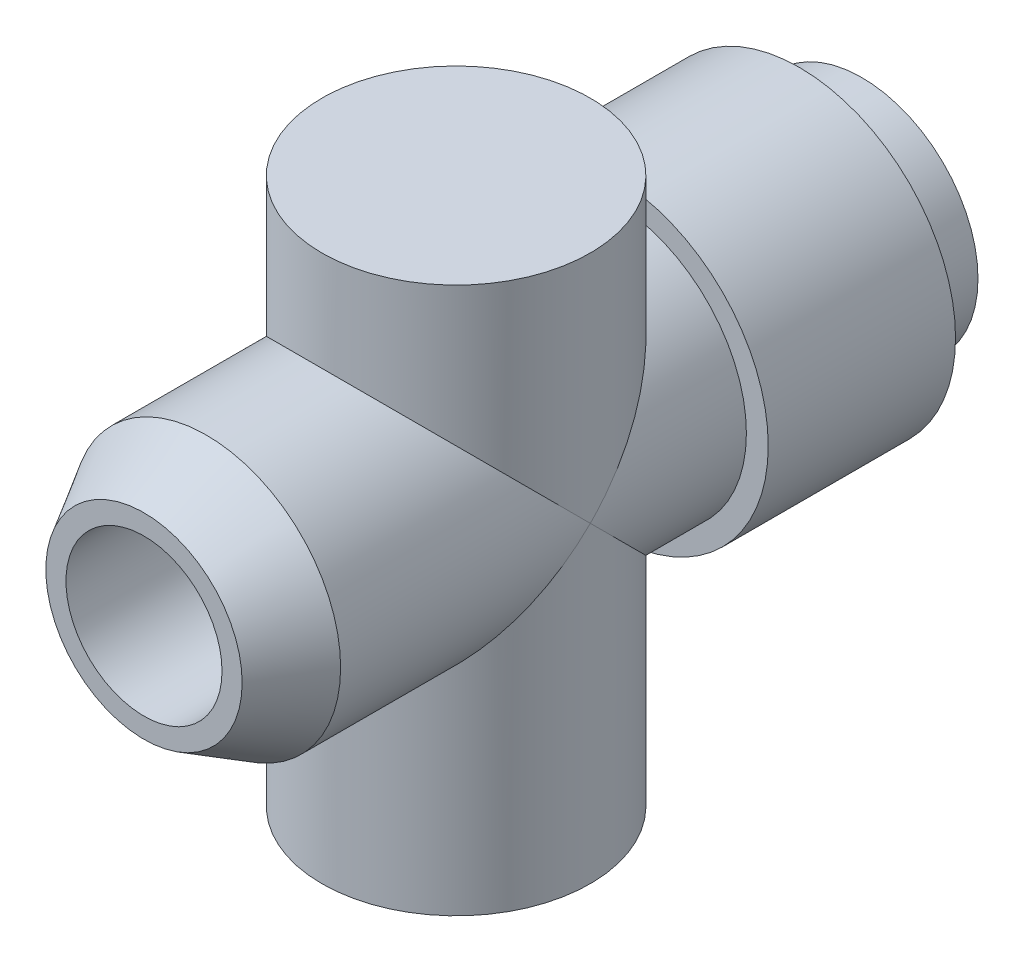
ISO-10303-21;
HEADER;
FILE_DESCRIPTION(('STEP AP214'),'2;1');
FILE_NAME('part.step','',(''),(''),'','','');
FILE_SCHEMA(('AUTOMOTIVE_DESIGN { 1 0 10303 214 1 1 1 1 }'));
ENDSEC;
DATA;
#1=APPLICATION_CONTEXT('core data for automotive mechanical design processes');
#2=APPLICATION_PROTOCOL_DEFINITION('international standard','automotive_design',2000,#1);
#3=PRODUCT_CONTEXT('',#1,'mechanical');
#4=PRODUCT('Part','Part','',(#3));
#5=PRODUCT_RELATED_PRODUCT_CATEGORY('part','',(#4));
#6=PRODUCT_DEFINITION_FORMATION('','',#4);
#7=PRODUCT_DEFINITION_CONTEXT('part definition',#1,'design');
#8=PRODUCT_DEFINITION('design','',#6,#7);
#9=PRODUCT_DEFINITION_SHAPE('','',#8);
#10=(LENGTH_UNIT() NAMED_UNIT(*) SI_UNIT(.MILLI.,.METRE.));
#11=(NAMED_UNIT(*) PLANE_ANGLE_UNIT() SI_UNIT($,.RADIAN.));
#12=(NAMED_UNIT(*) SI_UNIT($,.STERADIAN.) SOLID_ANGLE_UNIT());
#13=UNCERTAINTY_MEASURE_WITH_UNIT(LENGTH_MEASURE(1.E-05),#10,'distance_accuracy_value','');
#14=(GEOMETRIC_REPRESENTATION_CONTEXT(3) GLOBAL_UNCERTAINTY_ASSIGNED_CONTEXT((#13)) GLOBAL_UNIT_ASSIGNED_CONTEXT((#10,
#11,#12)) REPRESENTATION_CONTEXT('',''));
#15=CARTESIAN_POINT('',(0.,0.,0.));
#16=DIRECTION('',(0.,0.,1.));
#17=DIRECTION('',(1.,0.,0.));
#18=AXIS2_PLACEMENT_3D('',#15,#16,#17);
#19=CARTESIAN_POINT('',(0.,7.9375,16.51));
#20=DIRECTION('',(0.,-1.,0.));
#21=DIRECTION('',(0.,0.,-1.));
#22=AXIS2_PLACEMENT_3D('',#19,#20,#21);
#23=PLANE('',#22);
#24=CARTESIAN_POINT('',(0.,7.9375,16.51));
#25=DIRECTION('',(0.,-1.,0.));
#26=DIRECTION('',(0.,0.,-1.));
#27=AXIS2_PLACEMENT_3D('',#24,#25,#26);
#28=CIRCLE('',#27,3.175);
#29=CARTESIAN_POINT('',(0.,7.9375,13.335));
#30=VERTEX_POINT('',#29);
#31=EDGE_CURVE('E143',#30,#30,#28,.T.);
#32=ORIENTED_EDGE('',*,*,#31,.T.);
#33=EDGE_LOOP('',(#32));
#34=FACE_BOUND('',#33,.T.);
#35=CARTESIAN_POINT('',(0.,7.9375,16.51));
#36=DIRECTION('',(0.,-1.,0.));
#37=DIRECTION('',(0.,0.,-1.));
#38=AXIS2_PLACEMENT_3D('',#35,#36,#37);
#39=CIRCLE('',#38,3.048);
#40=CARTESIAN_POINT('',(0.,7.9375,13.462));
#41=VERTEX_POINT('',#40);
#42=EDGE_CURVE('E140',#41,#41,#39,.T.);
#43=ORIENTED_EDGE('',*,*,#42,.F.);
#44=EDGE_LOOP('',(#43));
#45=FACE_BOUND('',#44,.T.);
#46=ADVANCED_FACE('F31',(#34,#45),#23,.T.);
#47=CARTESIAN_POINT('',(0.,0.,0.));
#48=DIRECTION('',(0.,0.,1.));
#49=DIRECTION('',(1.,0.,0.));
#50=AXIS2_PLACEMENT_3D('',#47,#48,#49);
#51=CYLINDRICAL_SURFACE('',#50,3.175);
#52=CARTESIAN_POINT('',(3.175,0.,12.0668146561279));
#53=CARTESIAN_POINT('',(3.17500007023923,0.1609359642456,12.0668142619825));
#54=CARTESIAN_POINT('',(3.16268772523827,0.321873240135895,12.0579392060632));
#55=CARTESIAN_POINT('',(3.11428183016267,0.638414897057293,12.0239548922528));
#56=CARTESIAN_POINT('',(3.07816368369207,0.794013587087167,11.9988288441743));
#57=CARTESIAN_POINT('',(2.98445917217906,1.09466445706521,11.9363107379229));
#58=CARTESIAN_POINT('',(2.9270172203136,1.23977991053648,11.8990013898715));
#59=CARTESIAN_POINT('',(2.79275630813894,1.51824307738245,11.8164688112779));
#60=CARTESIAN_POINT('',(2.71593112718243,1.6515869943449,11.7712430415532));
#61=CARTESIAN_POINT('',(2.53485186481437,1.91941848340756,11.671728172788));
#62=CARTESIAN_POINT('',(2.42846906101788,2.05230276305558,11.6169936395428));
#63=CARTESIAN_POINT('',(2.19571018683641,2.29964695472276,11.5082072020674));
#64=CARTESIAN_POINT('',(2.06932053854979,2.41409424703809,11.4541557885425));
#65=CARTESIAN_POINT('',(1.78472313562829,2.63259925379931,11.346420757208));
#66=CARTESIAN_POINT('',(1.62460215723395,2.73449702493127,11.2933065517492));
#67=CARTESIAN_POINT('',(1.37076589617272,2.86543678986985,11.2231018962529));
#68=CARTESIAN_POINT('',(1.28384803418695,2.90544151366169,11.2012726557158));
#69=CARTESIAN_POINT('',(1.10602381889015,2.9776709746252,11.1614013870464));
#70=CARTESIAN_POINT('',(1.01512006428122,3.00990069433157,11.1433569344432));
#71=CARTESIAN_POINT('',(0.838428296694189,3.06356075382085,11.1130696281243));
#72=CARTESIAN_POINT('',(0.752920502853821,3.08570388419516,11.1004498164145));
#73=CARTESIAN_POINT('',(0.579922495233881,3.12284099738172,11.0791805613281));
#74=CARTESIAN_POINT('',(0.492433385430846,3.13783886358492,11.0705289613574));
#75=CARTESIAN_POINT('',(0.31622886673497,3.16045974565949,11.0574487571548));
#76=CARTESIAN_POINT('',(0.227514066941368,3.16808629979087,11.0530181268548));
#77=CARTESIAN_POINT('',(0.0496767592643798,3.17586083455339,11.0484998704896));
#78=CARTESIAN_POINT('',(-0.0394457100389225,3.17600950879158,11.0484118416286));
#79=CARTESIAN_POINT('',(-0.285401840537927,3.16603658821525,11.0542123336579));
#80=CARTESIAN_POINT('',(-0.4418974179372,3.14797422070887,11.0647226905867));
#81=CARTESIAN_POINT('',(-0.749075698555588,3.08933954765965,11.09840542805));
#82=CARTESIAN_POINT('',(-0.899757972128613,3.04876558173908,11.1215787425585));
#83=CARTESIAN_POINT('',(-1.19291338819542,2.94650155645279,11.1787751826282));
#84=CARTESIAN_POINT('',(-1.33531247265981,2.88464759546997,11.212882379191));
#85=CARTESIAN_POINT('',(-1.60791954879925,2.74206416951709,11.2891582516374));
#86=CARTESIAN_POINT('',(-1.73812407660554,2.66132936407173,11.3313292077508));
#87=CARTESIAN_POINT('',(-1.9987432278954,2.47273639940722,11.4258187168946));
#88=CARTESIAN_POINT('',(-2.1274494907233,2.3628237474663,11.4787466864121));
#89=CARTESIAN_POINT('',(-2.3656610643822,2.1243198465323,11.5862524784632));
#90=CARTESIAN_POINT('',(-2.4751417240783,1.99570499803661,11.6408323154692));
#91=CARTESIAN_POINT('',(-2.68338007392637,1.70733032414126,11.7521291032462));
#92=CARTESIAN_POINT('',(-2.77979750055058,1.54571736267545,11.8084666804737));
#93=CARTESIAN_POINT('',(-2.94349053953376,1.20500518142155,11.9091649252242));
#94=CARTESIAN_POINT('',(-3.01081871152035,1.02593822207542,11.9535471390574));
#95=CARTESIAN_POINT('',(-3.10063899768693,0.698772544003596,12.0143605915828));
#96=CARTESIAN_POINT('',(-3.12995612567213,0.553312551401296,12.0349129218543));
#97=CARTESIAN_POINT('',(-3.16793990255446,0.258479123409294,12.061713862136));
#98=CARTESIAN_POINT('',(-3.17662774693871,0.109109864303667,12.0679771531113));
#99=CARTESIAN_POINT('',(-3.17286544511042,-0.189336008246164,12.0652900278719));
#100=CARTESIAN_POINT('',(-3.16039749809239,-0.338412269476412,12.0563267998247));
#101=CARTESIAN_POINT('',(-3.11502731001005,-0.631919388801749,12.0244826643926));
#102=CARTESIAN_POINT('',(-3.08210971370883,-0.776346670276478,12.0015912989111));
#103=CARTESIAN_POINT('',(-2.99707204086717,-1.05833340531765,11.9446204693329));
#104=CARTESIAN_POINT('',(-2.94479778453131,-1.19582735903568,11.9104514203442));
#105=CARTESIAN_POINT('',(-2.82285849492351,-1.46060654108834,11.8346240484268));
#106=CARTESIAN_POINT('',(-2.75318655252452,-1.587887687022,11.7929627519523));
#107=CARTESIAN_POINT('',(-2.58462207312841,-1.85172082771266,11.6982331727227));
#108=CARTESIAN_POINT('',(-2.48276810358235,-1.98612360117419,11.6444335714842));
#109=CARTESIAN_POINT('',(-2.25915298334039,-2.23722631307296,11.5366504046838));
#110=CARTESIAN_POINT('',(-2.13737439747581,-2.35391057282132,11.482666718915));
#111=CARTESIAN_POINT('',(-1.8610893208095,-2.57915253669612,11.3735452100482));
#112=CARTESIAN_POINT('',(-1.70445717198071,-2.68540949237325,11.3189320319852));
#113=CARTESIAN_POINT('',(-1.45534676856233,-2.82340882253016,11.2457777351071));
#114=CARTESIAN_POINT('',(-1.36991710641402,-2.86585539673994,11.2228473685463));
#115=CARTESIAN_POINT('',(-1.19485625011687,-2.94314087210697,11.1805608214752));
#116=CARTESIAN_POINT('',(-1.10522772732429,-2.97798453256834,11.1612024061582));
#117=CARTESIAN_POINT('',(-0.929633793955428,-3.03715430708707,11.1280252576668));
#118=CARTESIAN_POINT('',(-0.843933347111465,-3.0620914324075,11.113890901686));
#119=CARTESIAN_POINT('',(-0.670244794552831,-3.10473632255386,11.0895778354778));
#120=CARTESIAN_POINT('',(-0.582257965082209,-3.12244803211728,11.0793969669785));
#121=CARTESIAN_POINT('',(-0.404758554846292,-3.15037417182,11.063292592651));
#122=CARTESIAN_POINT('',(-0.315246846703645,-3.16059275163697,11.0573667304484));
#123=CARTESIAN_POINT('',(-0.135527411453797,-3.17338724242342,11.0499394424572));
#124=CARTESIAN_POINT('',(-0.045319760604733,-3.17596397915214,11.0484375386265));
#125=CARTESIAN_POINT('',(0.202978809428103,-3.17243715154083,11.0504935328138));
#126=CARTESIAN_POINT('',(0.361013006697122,-3.15833180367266,11.0587156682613));
#127=CARTESIAN_POINT('',(0.671918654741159,-3.10709333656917,11.0882380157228));
#128=CARTESIAN_POINT('',(0.824789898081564,-3.06995929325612,11.1095387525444));
#129=CARTESIAN_POINT('',(1.12098184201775,-2.97458144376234,11.1631798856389));
#130=CARTESIAN_POINT('',(1.26433889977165,-2.91642421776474,11.1954749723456));
#131=CARTESIAN_POINT('',(1.5393828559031,-2.78108790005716,11.2685206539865));
#132=CARTESIAN_POINT('',(1.67106677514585,-2.70390397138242,11.3092733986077));
#133=CARTESIAN_POINT('',(1.93458729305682,-2.52314457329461,11.401044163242));
#134=CARTESIAN_POINT('',(2.06485087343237,-2.41760112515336,11.4526980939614));
#135=CARTESIAN_POINT('',(2.30686351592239,-2.18789704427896,11.5583960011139));
#136=CARTESIAN_POINT('',(2.41859037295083,-2.0637144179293,11.6124427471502));
#137=CARTESIAN_POINT('',(2.63314298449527,-1.78373214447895,11.7240539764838));
#138=CARTESIAN_POINT('',(2.73354922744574,-1.62594682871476,11.7813291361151));
#139=CARTESIAN_POINT('',(2.90607968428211,-1.29245787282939,11.8853468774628));
#140=CARTESIAN_POINT('',(2.97824068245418,-1.11677791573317,11.9321031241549));
#141=CARTESIAN_POINT('',(3.08040803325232,-0.784928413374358,12.0003779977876));
#142=CARTESIAN_POINT('',(3.11569503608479,-0.631023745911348,12.0249404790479));
#143=CARTESIAN_POINT('',(3.16297610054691,-0.318075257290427,12.0581488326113));
#144=CARTESIAN_POINT('',(3.174999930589,-0.159038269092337,12.0668150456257));
#145=CARTESIAN_POINT('',(3.175,0.,12.0668146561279));
#146=B_SPLINE_CURVE_WITH_KNOTS('',3,(#52,#53,#54,#55,#56,#57,#58,#59,#60,#61,#62,#63,#64,#65,
#66,#67,#68,#69,#70,#71,#72,#73,#74,#75,#76,#77,#78,#79,#80,#81,#82,#83,#84,#85,#86,#87,#88,#89,
#90,#91,#92,#93,#94,#95,#96,#97,#98,#99,#100,#101,#102,#103,#104,#105,#106,#107,#108,#109,#110,
#111,#112,#113,#114,#115,#116,#117,#118,#119,#120,#121,#122,#123,#124,#125,#126,#127,#128,#129,
#130,#131,#132,#133,#134,#135,#136,#137,#138,#139,#140,#141,#142,#143,#144,#145),.UNSPECIFIED.,
.T.,.F.,(4,2,2,2,2,2,2,2,2,2,2,2,2,2,2,2,2,2,2,2,2,2,2,2,2,2,2,2,2,2,2,2,2,2,2,2,2,2,2,2,2,2,2,
2,2,2,4),(0.,0.482141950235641,0.964782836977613,1.44421301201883,1.92379724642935,
2.45806607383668,2.99269905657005,3.58041708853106,3.87446419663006,4.16832236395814,
4.43562088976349,4.70277397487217,4.96979876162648,5.23679878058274,5.70797774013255,
6.17919145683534,6.65411894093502,7.12918092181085,7.65904357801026,8.18958074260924,
8.77593953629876,9.36123439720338,9.80868520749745,10.2556760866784,10.7030432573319,
11.1507467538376,11.6020958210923,12.0536244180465,12.5825316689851,13.1119042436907,
13.6994286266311,13.9933974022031,14.2871816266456,14.5578980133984,14.8284664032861,
15.0988848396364,15.3692740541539,15.8433628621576,16.3174706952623,16.7896478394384,
17.2619451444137,17.786136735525,18.3109517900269,18.8948716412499,19.4780284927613,
19.9550960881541,20.4315528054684),.UNSPECIFIED.);
#147=CARTESIAN_POINT('',(3.175,0.,12.0668146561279));
#148=VERTEX_POINT('',#147);
#149=EDGE_CURVE('E60',#148,#148,#146,.T.);
#150=ORIENTED_EDGE('',*,*,#149,.T.);
#151=EDGE_LOOP('',(#150));
#152=FACE_BOUND('',#151,.T.);
#153=CARTESIAN_POINT('',(0.,0.,0.));
#154=DIRECTION('',(0.,0.,1.));
#155=DIRECTION('',(1.,0.,0.));
#156=AXIS2_PLACEMENT_3D('',#153,#154,#155);
#157=CIRCLE('',#156,3.175);
#158=CARTESIAN_POINT('',(3.175,0.,0.));
#159=VERTEX_POINT('',#158);
#160=EDGE_CURVE('E69',#159,#159,#157,.T.);
#161=ORIENTED_EDGE('',*,*,#160,.F.);
#162=EDGE_LOOP('',(#161));
#163=FACE_BOUND('',#162,.T.);
#164=ADVANCED_FACE('F124',(#152,#163),#51,.F.);
#165=CARTESIAN_POINT('',(0.,0.,10.16));
#166=DIRECTION('',(0.,0.,1.));
#167=DIRECTION('',(1.,0.,0.));
#168=AXIS2_PLACEMENT_3D('',#165,#166,#167);
#169=PLANE('',#168);
#170=CARTESIAN_POINT('',(0.,0.,10.16));
#171=DIRECTION('',(0.,0.,1.));
#172=DIRECTION('',(1.,0.,0.));
#173=AXIS2_PLACEMENT_3D('',#170,#171,#172);
#174=CIRCLE('',#173,6.35);
#175=CARTESIAN_POINT('',(-6.35,0.,10.16));
#176=VERTEX_POINT('',#175);
#177=EDGE_CURVE('E80',#176,#176,#174,.T.);
#178=ORIENTED_EDGE('',*,*,#177,.T.);
#179=EDGE_LOOP('',(#178));
#180=FACE_BOUND('',#179,.T.);
#181=CARTESIAN_POINT('',(0.,0.,10.16));
#182=DIRECTION('',(0.,0.,1.));
#183=DIRECTION('',(1.,0.,0.));
#184=AXIS2_PLACEMENT_3D('',#181,#182,#183);
#185=CIRCLE('',#184,5.461);
#186=CARTESIAN_POINT('',(5.461,0.,10.16));
#187=VERTEX_POINT('',#186);
#188=EDGE_CURVE('E72',#187,#187,#185,.T.);
#189=ORIENTED_EDGE('',*,*,#188,.F.);
#190=EDGE_LOOP('',(#189));
#191=FACE_BOUND('',#190,.T.);
#192=ADVANCED_FACE('F192',(#180,#191),#169,.T.);
#193=CARTESIAN_POINT('',(0.,0.,2.54));
#194=DIRECTION('',(0.,0.,-1.));
#195=DIRECTION('',(-1.,0.,0.));
#196=AXIS2_PLACEMENT_3D('',#193,#194,#195);
#197=CYLINDRICAL_SURFACE('',#196,4.7244);
#198=CARTESIAN_POINT('',(0.,0.,2.54));
#199=DIRECTION('',(0.,0.,1.));
#200=DIRECTION('',(1.,0.,0.));
#201=AXIS2_PLACEMENT_3D('',#198,#199,#200);
#202=CIRCLE('',#201,4.7244);
#203=CARTESIAN_POINT('',(4.7244,0.,2.54));
#204=VERTEX_POINT('',#203);
#205=EDGE_CURVE('E86',#204,#204,#202,.T.);
#206=ORIENTED_EDGE('',*,*,#205,.F.);
#207=EDGE_LOOP('',(#206));
#208=FACE_BOUND('',#207,.T.);
#209=CARTESIAN_POINT('',(0.,0.,0.));
#210=DIRECTION('',(0.,0.,1.));
#211=DIRECTION('',(1.,0.,0.));
#212=AXIS2_PLACEMENT_3D('',#209,#210,#211);
#213=CIRCLE('',#212,4.7244);
#214=CARTESIAN_POINT('',(4.7244,0.,0.));
#215=VERTEX_POINT('',#214);
#216=EDGE_CURVE('E83',#215,#215,#213,.T.);
#217=ORIENTED_EDGE('',*,*,#216,.T.);
#218=EDGE_LOOP('',(#217));
#219=FACE_BOUND('',#218,.T.);
#220=ADVANCED_FACE('F195',(#208,#219),#197,.T.);
#221=CARTESIAN_POINT('',(0.,0.,0.));
#222=DIRECTION('',(0.,0.,1.));
#223=DIRECTION('',(1.,0.,0.));
#224=AXIS2_PLACEMENT_3D('',#221,#222,#223);
#225=PLANE('',#224);
#226=ORIENTED_EDGE('',*,*,#160,.T.);
#227=EDGE_LOOP('',(#226));
#228=FACE_BOUND('',#227,.T.);
#229=ORIENTED_EDGE('',*,*,#216,.F.);
#230=EDGE_LOOP('',(#229));
#231=FACE_BOUND('',#230,.T.);
#232=ADVANCED_FACE('F190',(#228,#231),#225,.F.);
#233=CARTESIAN_POINT('',(0.,0.,2.54));
#234=DIRECTION('',(0.,0.,1.));
#235=DIRECTION('',(1.,0.,0.));
#236=AXIS2_PLACEMENT_3D('',#233,#234,#235);
#237=PLANE('',#236);
#238=CARTESIAN_POINT('',(0.,0.,2.54));
#239=DIRECTION('',(0.,0.,1.));
#240=DIRECTION('',(1.,0.,0.));
#241=AXIS2_PLACEMENT_3D('',#238,#239,#240);
#242=CIRCLE('',#241,6.35);
#243=CARTESIAN_POINT('',(-6.35,0.,2.54));
#244=VERTEX_POINT('',#243);
#245=EDGE_CURVE('E77',#244,#244,#242,.T.);
#246=ORIENTED_EDGE('',*,*,#245,.F.);
#247=EDGE_LOOP('',(#246));
#248=FACE_BOUND('',#247,.T.);
#249=ORIENTED_EDGE('',*,*,#205,.T.);
#250=EDGE_LOOP('',(#249));
#251=FACE_BOUND('',#250,.T.);
#252=ADVANCED_FACE('F187',(#248,#251),#237,.F.);
#253=CARTESIAN_POINT('',(0.,0.,10.16));
#254=DIRECTION('',(0.,0.,-1.));
#255=DIRECTION('',(-1.,0.,0.));
#256=AXIS2_PLACEMENT_3D('',#253,#254,#255);
#257=CYLINDRICAL_SURFACE('',#256,6.35);
#258=CARTESIAN_POINT('',(-6.35,0.,10.16));
#259=CARTESIAN_POINT('',(-6.35,0.,10.080625));
#260=CARTESIAN_POINT('',(-6.35,0.,10.00125));
#261=CARTESIAN_POINT('',(-6.35,0.,9.8425));
#262=CARTESIAN_POINT('',(-6.35,0.,9.763125));
#263=CARTESIAN_POINT('',(-6.35,0.,9.604375));
#264=CARTESIAN_POINT('',(-6.35,0.,9.525));
#265=CARTESIAN_POINT('',(-6.35,0.,9.36625));
#266=CARTESIAN_POINT('',(-6.35,0.,9.286875));
#267=CARTESIAN_POINT('',(-6.35,0.,9.128125));
#268=CARTESIAN_POINT('',(-6.35,0.,9.04875));
#269=CARTESIAN_POINT('',(-6.35,0.,8.89));
#270=CARTESIAN_POINT('',(-6.35,0.,8.810625));
#271=CARTESIAN_POINT('',(-6.35,0.,8.651875));
#272=CARTESIAN_POINT('',(-6.35,0.,8.5725));
#273=CARTESIAN_POINT('',(-6.35,0.,8.41375));
#274=CARTESIAN_POINT('',(-6.35,0.,8.334375));
#275=CARTESIAN_POINT('',(-6.35,0.,8.175625));
#276=CARTESIAN_POINT('',(-6.35,0.,8.09625));
#277=CARTESIAN_POINT('',(-6.35,0.,7.9375));
#278=CARTESIAN_POINT('',(-6.35,0.,7.858125));
#279=CARTESIAN_POINT('',(-6.35,0.,7.699375));
#280=CARTESIAN_POINT('',(-6.35,0.,7.62));
#281=CARTESIAN_POINT('',(-6.35,0.,7.46125));
#282=CARTESIAN_POINT('',(-6.35,0.,7.381875));
#283=CARTESIAN_POINT('',(-6.35,0.,7.223125));
#284=CARTESIAN_POINT('',(-6.35,0.,7.14375));
#285=CARTESIAN_POINT('',(-6.35,0.,6.985));
#286=CARTESIAN_POINT('',(-6.35,0.,6.905625));
#287=CARTESIAN_POINT('',(-6.35,0.,6.746875));
#288=CARTESIAN_POINT('',(-6.35,0.,6.6675));
#289=CARTESIAN_POINT('',(-6.35,0.,6.50875));
#290=CARTESIAN_POINT('',(-6.35,0.,6.429375));
#291=CARTESIAN_POINT('',(-6.35,0.,6.270625));
#292=CARTESIAN_POINT('',(-6.35,0.,6.19125));
#293=CARTESIAN_POINT('',(-6.35,0.,6.0325));
#294=CARTESIAN_POINT('',(-6.35,0.,5.953125));
#295=CARTESIAN_POINT('',(-6.35,0.,5.794375));
#296=CARTESIAN_POINT('',(-6.35,0.,5.715));
#297=CARTESIAN_POINT('',(-6.35,0.,5.55625));
#298=CARTESIAN_POINT('',(-6.35,0.,5.476875));
#299=CARTESIAN_POINT('',(-6.35,0.,5.318125));
#300=CARTESIAN_POINT('',(-6.35,0.,5.23875));
#301=CARTESIAN_POINT('',(-6.35,0.,5.08));
#302=CARTESIAN_POINT('',(-6.35,0.,5.000625));
#303=CARTESIAN_POINT('',(-6.35,0.,4.841875));
#304=CARTESIAN_POINT('',(-6.35,0.,4.7625));
#305=CARTESIAN_POINT('',(-6.35,0.,4.60375));
#306=CARTESIAN_POINT('',(-6.35,0.,4.524375));
#307=CARTESIAN_POINT('',(-6.35,0.,4.365625));
#308=CARTESIAN_POINT('',(-6.35,0.,4.28625));
#309=CARTESIAN_POINT('',(-6.35,0.,4.1275));
#310=CARTESIAN_POINT('',(-6.35,0.,4.048125));
#311=CARTESIAN_POINT('',(-6.35,0.,3.889375));
#312=CARTESIAN_POINT('',(-6.35,0.,3.81));
#313=CARTESIAN_POINT('',(-6.35,0.,3.65125));
#314=CARTESIAN_POINT('',(-6.35,0.,3.571875));
#315=CARTESIAN_POINT('',(-6.35,0.,3.413125));
#316=CARTESIAN_POINT('',(-6.35,0.,3.33375));
#317=CARTESIAN_POINT('',(-6.35,0.,3.175));
#318=CARTESIAN_POINT('',(-6.35,0.,3.095625));
#319=CARTESIAN_POINT('',(-6.35,0.,2.936875));
#320=CARTESIAN_POINT('',(-6.35,0.,2.8575));
#321=CARTESIAN_POINT('',(-6.35,0.,2.69875));
#322=CARTESIAN_POINT('',(-6.35,0.,2.619375));
#323=CARTESIAN_POINT('',(-6.35,0.,2.54));
#324=B_SPLINE_CURVE_WITH_KNOTS('',3,(#258,#259,#260,#261,#262,#263,#264,#265,#266,#267,#268,
#269,#270,#271,#272,#273,#274,#275,#276,#277,#278,#279,#280,#281,#282,#283,#284,#285,#286,#287,
#288,#289,#290,#291,#292,#293,#294,#295,#296,#297,#298,#299,#300,#301,#302,#303,#304,#305,#306,
#307,#308,#309,#310,#311,#312,#313,#314,#315,#316,#317,#318,#319,#320,#321,#322,#323),
.UNSPECIFIED.,.F.,.F.,(4,2,2,2,2,2,2,2,2,2,2,2,2,2,2,2,2,2,2,2,2,2,2,2,2,2,2,2,2,2,2,2,4),(0.,
0.238124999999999,0.476249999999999,0.714375,0.952499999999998,1.190625,1.42875,1.666875,1.905,
2.143125,2.38125,2.619375,2.8575,3.095625,3.33375,3.571875,3.81,4.048125,4.28625,4.524375,
4.7625,5.000625,5.23875,5.476875,5.715,5.953125,6.19125,6.429375,6.6675,6.905625,7.14375,
7.381875,7.62),.UNSPECIFIED.);
#325=EDGE_CURVE('BSEAM165',#176,#244,#324,.T.);
#326=ORIENTED_EDGE('',*,*,#177,.F.);
#327=ORIENTED_EDGE('',*,*,#245,.T.);
#328=ORIENTED_EDGE('',*,*,#325,.T.);
#329=ORIENTED_EDGE('',*,*,#325,.F.);
#330=EDGE_LOOP('',(#326,#328,#327,#329));
#331=FACE_BOUND('',#330,.T.);
#332=ADVANCED_FACE('F165',(#331),#257,.T.);
#333=CARTESIAN_POINT('',(0.,0.,29.21));
#334=DIRECTION('',(0.,0.,-1.));
#335=DIRECTION('',(-1.,0.,0.));
#336=AXIS2_PLACEMENT_3D('',#333,#334,#335);
#337=CYLINDRICAL_SURFACE('',#336,5.461);
#338=CARTESIAN_POINT('',(0.,0.,16.51));
#339=DIRECTION('',(0.,-0.707106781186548,-0.707106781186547));
#340=DIRECTION('',(0.,0.707106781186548,-0.707106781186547));
#341=AXIS2_PLACEMENT_3D('',#338,#339,#340);
#342=ELLIPSE('',#341,7.72302026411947,5.461);
#343=CARTESIAN_POINT('',(-5.461,0.,16.51));
#344=VERTEX_POINT('',#343);
#345=CARTESIAN_POINT('',(5.461,0.,16.51));
#346=VERTEX_POINT('',#345);
#347=EDGE_CURVE('E51',#344,#346,#342,.T.);
#348=ORIENTED_EDGE('',*,*,#347,.T.);
#349=CARTESIAN_POINT('',(0.,0.,16.51));
#350=DIRECTION('',(0.,0.707106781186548,-0.707106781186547));
#351=DIRECTION('',(0.,-0.707106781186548,-0.707106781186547));
#352=AXIS2_PLACEMENT_3D('',#349,#350,#351);
#353=ELLIPSE('',#352,7.72302026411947,5.461);
#354=EDGE_CURVE('E56',#346,#344,#353,.T.);
#355=ORIENTED_EDGE('',*,*,#354,.T.);
#356=EDGE_LOOP('',(#348,#355));
#357=FACE_BOUND('',#356,.T.);
#358=ORIENTED_EDGE('',*,*,#188,.T.);
#359=EDGE_LOOP('',(#358));
#360=FACE_BOUND('',#359,.T.);
#361=ADVANCED_FACE('F65',(#357,#360),#337,.T.);
#362=CARTESIAN_POINT('',(0.,-12.7,16.51));
#363=DIRECTION('',(0.,1.,0.));
#364=DIRECTION('',(0.,0.,1.));
#365=AXIS2_PLACEMENT_3D('',#362,#363,#364);
#366=CYLINDRICAL_SURFACE('',#365,5.461);
#367=ORIENTED_EDGE('',*,*,#149,.F.);
#368=EDGE_LOOP('',(#367));
#369=FACE_BOUND('',#368,.T.);
#370=ADVANCED_FACE('F112',(#369),#366,.T.);
#371=CARTESIAN_POINT('',(0.,-12.7,16.51));
#372=DIRECTION('',(0.,1.,0.));
#373=DIRECTION('',(0.,0.,1.));
#374=AXIS2_PLACEMENT_3D('',#371,#372,#373);
#375=PLANE('',#374);
#376=CARTESIAN_POINT('',(0.,-12.7,16.51));
#377=DIRECTION('',(0.,-1.,0.));
#378=DIRECTION('',(0.,0.,-1.));
#379=AXIS2_PLACEMENT_3D('',#376,#377,#378);
#380=CIRCLE('',#379,3.175);
#381=CARTESIAN_POINT('',(0.,-12.7,13.335));
#382=VERTEX_POINT('',#381);
#383=EDGE_CURVE('E139',#382,#382,#380,.T.);
#384=ORIENTED_EDGE('',*,*,#383,.F.);
#385=EDGE_LOOP('',(#384));
#386=FACE_BOUND('',#385,.T.);
#387=CARTESIAN_POINT('',(0.,-12.7,16.51));
#388=DIRECTION('',(0.,1.,0.));
#389=DIRECTION('',(0.,0.,1.));
#390=AXIS2_PLACEMENT_3D('',#387,#388,#389);
#391=CIRCLE('',#390,5.461);
#392=CARTESIAN_POINT('',(0.,-12.7,21.971));
#393=VERTEX_POINT('',#392);
#394=EDGE_CURVE('E96',#393,#393,#391,.T.);
#395=ORIENTED_EDGE('',*,*,#394,.F.);
#396=EDGE_LOOP('',(#395));
#397=FACE_BOUND('',#396,.T.);
#398=ADVANCED_FACE('F108',(#386,#397),#375,.F.);
#399=ORIENTED_EDGE('',*,*,#394,.T.);
#400=EDGE_LOOP('',(#399));
#401=FACE_BOUND('',#400,.T.);
#402=ORIENTED_EDGE('',*,*,#354,.F.);
#403=CARTESIAN_POINT('',(0.,0.,16.51));
#404=DIRECTION('',(0.,-0.707106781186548,-0.707106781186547));
#405=DIRECTION('',(0.,0.707106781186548,-0.707106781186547));
#406=AXIS2_PLACEMENT_3D('',#403,#404,#405);
#407=ELLIPSE('',#406,7.72302026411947,5.461);
#408=EDGE_CURVE('E45',#344,#346,#407,.F.);
#409=ORIENTED_EDGE('',*,*,#408,.F.);
#410=EDGE_LOOP('',(#402,#409));
#411=FACE_BOUND('',#410,.T.);
#412=ADVANCED_FACE('F59',(#401,#411),#366,.T.);
#413=CARTESIAN_POINT('',(0.,9.525,16.51));
#414=DIRECTION('',(0.,1.,0.));
#415=DIRECTION('',(0.,0.,1.));
#416=AXIS2_PLACEMENT_3D('',#413,#414,#415);
#417=CIRCLE('',#416,5.461);
#418=CARTESIAN_POINT('',(0.,9.525,21.971));
#419=VERTEX_POINT('',#418);
#420=EDGE_CURVE('E149',#419,#419,#417,.T.);
#421=ORIENTED_EDGE('',*,*,#420,.F.);
#422=EDGE_LOOP('',(#421));
#423=FACE_BOUND('',#422,.T.);
#424=CARTESIAN_POINT('',(0.,0.,16.51));
#425=DIRECTION('',(0.,0.707106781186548,-0.707106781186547));
#426=DIRECTION('',(0.,-0.707106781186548,-0.707106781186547));
#427=AXIS2_PLACEMENT_3D('',#424,#425,#426);
#428=ELLIPSE('',#427,7.72302026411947,5.461);
#429=EDGE_CURVE('E53',#346,#344,#428,.F.);
#430=ORIENTED_EDGE('',*,*,#429,.F.);
#431=ORIENTED_EDGE('',*,*,#347,.F.);
#432=EDGE_LOOP('',(#430,#431));
#433=FACE_BOUND('',#432,.T.);
#434=ADVANCED_FACE('F52',(#423,#433),#366,.T.);
#435=CARTESIAN_POINT('',(0.,9.525,16.51));
#436=DIRECTION('',(0.,1.,0.));
#437=DIRECTION('',(0.,0.,1.));
#438=AXIS2_PLACEMENT_3D('',#435,#436,#437);
#439=PLANE('',#438);
#440=ORIENTED_EDGE('',*,*,#420,.T.);
#441=EDGE_LOOP('',(#440));
#442=FACE_BOUND('',#441,.T.);
#443=ADVANCED_FACE('F105',(#442),#439,.T.);
#444=CARTESIAN_POINT('',(0.,0.,26.67));
#445=DIRECTION('',(0.,0.,1.));
#446=DIRECTION('',(1.,0.,0.));
#447=AXIS2_PLACEMENT_3D('',#444,#445,#446);
#448=CIRCLE('',#447,5.461);
#449=CARTESIAN_POINT('',(5.461,0.,26.67));
#450=VERTEX_POINT('',#449);
#451=EDGE_CURVE('E11',#450,#450,#448,.F.);
#452=ORIENTED_EDGE('',*,*,#451,.T.);
#453=EDGE_LOOP('',(#452));
#454=FACE_BOUND('',#453,.T.);
#455=ORIENTED_EDGE('',*,*,#408,.T.);
#456=ORIENTED_EDGE('',*,*,#429,.T.);
#457=EDGE_LOOP('',(#455,#456));
#458=FACE_BOUND('',#457,.T.);
#459=ADVANCED_FACE('F62',(#454,#458),#337,.T.);
#460=CARTESIAN_POINT('',(0.,0.,29.21));
#461=DIRECTION('',(0.,0.,1.));
#462=DIRECTION('',(1.,0.,0.));
#463=AXIS2_PLACEMENT_3D('',#460,#461,#462);
#464=PLANE('',#463);
#465=CARTESIAN_POINT('',(0.,0.,29.21));
#466=DIRECTION('',(0.,0.,1.));
#467=DIRECTION('',(1.,0.,0.));
#468=AXIS2_PLACEMENT_3D('',#465,#466,#467);
#469=CIRCLE('',#468,3.99453031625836);
#470=CARTESIAN_POINT('',(3.99453031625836,0.,29.21));
#471=VERTEX_POINT('',#470);
#472=EDGE_CURVE('E39',#471,#471,#469,.T.);
#473=ORIENTED_EDGE('',*,*,#472,.T.);
#474=EDGE_LOOP('',(#473));
#475=FACE_BOUND('',#474,.T.);
#476=CARTESIAN_POINT('',(0.,0.,29.21));
#477=DIRECTION('',(0.,0.,1.));
#478=DIRECTION('',(1.,0.,0.));
#479=AXIS2_PLACEMENT_3D('',#476,#477,#478);
#480=CIRCLE('',#479,3.175);
#481=CARTESIAN_POINT('',(3.175,0.,29.21));
#482=VERTEX_POINT('',#481);
#483=EDGE_CURVE('E63',#482,#482,#480,.T.);
#484=ORIENTED_EDGE('',*,*,#483,.F.);
#485=EDGE_LOOP('',(#484));
#486=FACE_BOUND('',#485,.T.);
#487=ADVANCED_FACE('F173',(#475,#486),#464,.T.);
#488=CARTESIAN_POINT('',(3.175,0.,20.9531853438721));
#489=CARTESIAN_POINT('',(3.17500007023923,-0.1609359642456,20.9531857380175));
#490=CARTESIAN_POINT('',(3.16268772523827,-0.321873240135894,20.9620607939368));
#491=CARTESIAN_POINT('',(3.11428183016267,-0.638414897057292,20.9960451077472));
#492=CARTESIAN_POINT('',(3.07816368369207,-0.794013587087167,21.0211711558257));
#493=CARTESIAN_POINT('',(2.98445917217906,-1.09466445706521,21.0836892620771));
#494=CARTESIAN_POINT('',(2.9270172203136,-1.23977991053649,21.1209986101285));
#495=CARTESIAN_POINT('',(2.79275630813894,-1.51824307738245,21.203531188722));
#496=CARTESIAN_POINT('',(2.71593112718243,-1.6515869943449,21.2487569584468));
#497=CARTESIAN_POINT('',(2.53485186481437,-1.91941848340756,21.348271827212));
#498=CARTESIAN_POINT('',(2.42846906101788,-2.05230276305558,21.4030063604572));
#499=CARTESIAN_POINT('',(2.19571018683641,-2.29964695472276,21.5117927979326));
#500=CARTESIAN_POINT('',(2.06932053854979,-2.41409424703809,21.5658442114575));
#501=CARTESIAN_POINT('',(1.78472313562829,-2.63259925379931,21.673579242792));
#502=CARTESIAN_POINT('',(1.62460215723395,-2.73449702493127,21.7266934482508));
#503=CARTESIAN_POINT('',(1.37076589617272,-2.86543678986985,21.7968981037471));
#504=CARTESIAN_POINT('',(1.28384803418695,-2.90544151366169,21.8187273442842));
#505=CARTESIAN_POINT('',(1.10602381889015,-2.9776709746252,21.8585986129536));
#506=CARTESIAN_POINT('',(1.01512006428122,-3.00990069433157,21.8766430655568));
#507=CARTESIAN_POINT('',(0.838428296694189,-3.06356075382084,21.9069303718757));
#508=CARTESIAN_POINT('',(0.752920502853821,-3.08570388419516,21.9195501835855));
#509=CARTESIAN_POINT('',(0.579922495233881,-3.12284099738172,21.9408194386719));
#510=CARTESIAN_POINT('',(0.492433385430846,-3.13783886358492,21.9494710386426));
#511=CARTESIAN_POINT('',(0.316228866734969,-3.16045974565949,21.9625512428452));
#512=CARTESIAN_POINT('',(0.227514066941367,-3.16808629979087,21.9669818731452));
#513=CARTESIAN_POINT('',(0.0496767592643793,-3.17586083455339,21.9715001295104));
#514=CARTESIAN_POINT('',(-0.0394457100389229,-3.17600950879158,21.9715881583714));
#515=CARTESIAN_POINT('',(-0.285401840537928,-3.16603658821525,21.9657876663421));
#516=CARTESIAN_POINT('',(-0.441897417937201,-3.14797422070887,21.9552773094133));
#517=CARTESIAN_POINT('',(-0.749075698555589,-3.08933954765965,21.92159457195));
#518=CARTESIAN_POINT('',(-0.899757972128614,-3.04876558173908,21.8984212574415));
#519=CARTESIAN_POINT('',(-1.19291338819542,-2.94650155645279,21.8412248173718));
#520=CARTESIAN_POINT('',(-1.33531247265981,-2.88464759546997,21.8071176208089));
#521=CARTESIAN_POINT('',(-1.60791954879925,-2.74206416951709,21.7308417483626));
#522=CARTESIAN_POINT('',(-1.73812407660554,-2.66132936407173,21.6886707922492));
#523=CARTESIAN_POINT('',(-1.9987432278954,-2.47273639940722,21.5941812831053));
#524=CARTESIAN_POINT('',(-2.1274494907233,-2.3628237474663,21.5412533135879));
#525=CARTESIAN_POINT('',(-2.3656610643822,-2.1243198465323,21.4337475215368));
#526=CARTESIAN_POINT('',(-2.4751417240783,-1.99570499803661,21.3791676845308));
#527=CARTESIAN_POINT('',(-2.68338007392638,-1.70733032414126,21.2678708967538));
#528=CARTESIAN_POINT('',(-2.77979750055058,-1.54571736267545,21.2115333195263));
#529=CARTESIAN_POINT('',(-2.94349053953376,-1.20500518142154,21.1108350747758));
#530=CARTESIAN_POINT('',(-3.01081871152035,-1.02593822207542,21.0664528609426));
#531=CARTESIAN_POINT('',(-3.10063899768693,-0.698772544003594,21.0056394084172));
#532=CARTESIAN_POINT('',(-3.12995612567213,-0.553312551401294,20.9850870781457));
#533=CARTESIAN_POINT('',(-3.16793990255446,-0.258479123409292,20.958286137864));
#534=CARTESIAN_POINT('',(-3.17662774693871,-0.109109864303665,20.9520228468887));
#535=CARTESIAN_POINT('',(-3.17286544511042,0.189336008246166,20.9547099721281));
#536=CARTESIAN_POINT('',(-3.16039749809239,0.338412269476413,20.9636732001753));
#537=CARTESIAN_POINT('',(-3.11502731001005,0.63191938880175,20.9955173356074));
#538=CARTESIAN_POINT('',(-3.08210971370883,0.776346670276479,21.0184087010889));
#539=CARTESIAN_POINT('',(-2.99707204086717,1.05833340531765,21.0753795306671));
#540=CARTESIAN_POINT('',(-2.94479778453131,1.19582735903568,21.1095485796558));
#541=CARTESIAN_POINT('',(-2.8228584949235,1.46060654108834,21.1853759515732));
#542=CARTESIAN_POINT('',(-2.75318655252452,1.587887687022,21.2270372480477));
#543=CARTESIAN_POINT('',(-2.58462207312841,1.85172082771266,21.3217668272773));
#544=CARTESIAN_POINT('',(-2.48276810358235,1.98612360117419,21.3755664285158));
#545=CARTESIAN_POINT('',(-2.25915298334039,2.23722631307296,21.4833495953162));
#546=CARTESIAN_POINT('',(-2.13737439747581,2.35391057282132,21.5373332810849));
#547=CARTESIAN_POINT('',(-1.8610893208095,2.57915253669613,21.6464547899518));
#548=CARTESIAN_POINT('',(-1.70445717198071,2.68540949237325,21.7010679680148));
#549=CARTESIAN_POINT('',(-1.45534676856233,2.82340882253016,21.7742222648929));
#550=CARTESIAN_POINT('',(-1.36991710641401,2.86585539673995,21.7971526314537));
#551=CARTESIAN_POINT('',(-1.19485625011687,2.94314087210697,21.8394391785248));
#552=CARTESIAN_POINT('',(-1.10522772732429,2.97798453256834,21.8587975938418));
#553=CARTESIAN_POINT('',(-0.929633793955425,3.03715430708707,21.8919747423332));
#554=CARTESIAN_POINT('',(-0.843933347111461,3.06209143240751,21.906109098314));
#555=CARTESIAN_POINT('',(-0.670244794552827,3.10473632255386,21.9304221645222));
#556=CARTESIAN_POINT('',(-0.582257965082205,3.12244803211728,21.9406030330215));
#557=CARTESIAN_POINT('',(-0.404758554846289,3.15037417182,21.956707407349));
#558=CARTESIAN_POINT('',(-0.315246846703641,3.16059275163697,21.9626332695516));
#559=CARTESIAN_POINT('',(-0.135527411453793,3.17338724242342,21.9700605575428));
#560=CARTESIAN_POINT('',(-0.0453197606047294,3.17596397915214,21.9715624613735));
#561=CARTESIAN_POINT('',(0.202978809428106,3.17243715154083,21.9695064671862));
#562=CARTESIAN_POINT('',(0.361013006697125,3.15833180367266,21.9612843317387));
#563=CARTESIAN_POINT('',(0.671918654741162,3.10709333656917,21.9317619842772));
#564=CARTESIAN_POINT('',(0.824789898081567,3.06995929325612,21.9104612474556));
#565=CARTESIAN_POINT('',(1.12098184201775,2.97458144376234,21.8568201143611));
#566=CARTESIAN_POINT('',(1.26433889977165,2.91642421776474,21.8245250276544));
#567=CARTESIAN_POINT('',(1.53938285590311,2.78108790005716,21.7514793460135));
#568=CARTESIAN_POINT('',(1.67106677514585,2.70390397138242,21.7107266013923));
#569=CARTESIAN_POINT('',(1.93458729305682,2.52314457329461,21.618955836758));
#570=CARTESIAN_POINT('',(2.06485087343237,2.41760112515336,21.5673019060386));
#571=CARTESIAN_POINT('',(2.30686351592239,2.18789704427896,21.4616039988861));
#572=CARTESIAN_POINT('',(2.41859037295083,2.0637144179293,21.4075572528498));
#573=CARTESIAN_POINT('',(2.63314298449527,1.78373214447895,21.2959460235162));
#574=CARTESIAN_POINT('',(2.73354922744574,1.62594682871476,21.2386708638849));
#575=CARTESIAN_POINT('',(2.90607968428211,1.2924578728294,21.1346531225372));
#576=CARTESIAN_POINT('',(2.97824068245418,1.11677791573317,21.0878968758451));
#577=CARTESIAN_POINT('',(3.08040803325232,0.784928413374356,21.0196220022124));
#578=CARTESIAN_POINT('',(3.11569503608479,0.631023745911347,20.9950595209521));
#579=CARTESIAN_POINT('',(3.16297610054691,0.318075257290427,20.9618511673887));
#580=CARTESIAN_POINT('',(3.174999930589,0.159038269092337,20.9531849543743));
#581=CARTESIAN_POINT('',(3.175,0.,20.9531853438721));
#582=B_SPLINE_CURVE_WITH_KNOTS('',3,(#488,#489,#490,#491,#492,#493,#494,#495,#496,#497,#498,
#499,#500,#501,#502,#503,#504,#505,#506,#507,#508,#509,#510,#511,#512,#513,#514,#515,#516,#517,
#518,#519,#520,#521,#522,#523,#524,#525,#526,#527,#528,#529,#530,#531,#532,#533,#534,#535,#536,
#537,#538,#539,#540,#541,#542,#543,#544,#545,#546,#547,#548,#549,#550,#551,#552,#553,#554,#555,
#556,#557,#558,#559,#560,#561,#562,#563,#564,#565,#566,#567,#568,#569,#570,#571,#572,#573,#574,
#575,#576,#577,#578,#579,#580,#581),.UNSPECIFIED.,.T.,.F.,(4,2,2,2,2,2,2,2,2,2,2,2,2,2,2,2,2,2,
2,2,2,2,2,2,2,2,2,2,2,2,2,2,2,2,2,2,2,2,2,2,2,2,2,2,2,2,4),(0.,0.482141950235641,
0.964782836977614,1.44421301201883,1.92379724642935,2.45806607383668,2.99269905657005,
3.58041708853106,3.87446419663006,4.16832236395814,4.43562088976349,4.70277397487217,
4.96979876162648,5.23679878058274,5.70797774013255,6.17919145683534,6.65411894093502,
7.12918092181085,7.65904357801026,8.18958074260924,8.77593953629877,9.36123439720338,
9.80868520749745,10.2556760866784,10.7030432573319,11.1507467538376,11.6020958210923,
12.0536244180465,12.5825316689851,13.1119042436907,13.6994286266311,13.9933974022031,
14.2871816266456,14.5578980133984,14.8284664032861,15.0988848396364,15.3692740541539,
15.8433628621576,16.3174706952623,16.7896478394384,17.2619451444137,17.786136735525,
18.3109517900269,18.8948716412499,19.4780284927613,19.9550960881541,20.4315528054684),.UNSPECIFIED.);
#583=CARTESIAN_POINT('',(3.175,0.,20.9531853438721));
#584=VERTEX_POINT('',#583);
#585=EDGE_CURVE('E89',#584,#584,#582,.T.);
#586=ORIENTED_EDGE('',*,*,#585,.T.);
#587=EDGE_LOOP('',(#586));
#588=FACE_BOUND('',#587,.T.);
#589=ORIENTED_EDGE('',*,*,#483,.T.);
#590=EDGE_LOOP('',(#589));
#591=FACE_BOUND('',#590,.T.);
#592=ADVANCED_FACE('F99',(#588,#591),#51,.F.);
#593=ORIENTED_EDGE('',*,*,#585,.F.);
#594=EDGE_LOOP('',(#593));
#595=FACE_BOUND('',#594,.T.);
#596=ADVANCED_FACE('F107',(#595),#366,.T.);
#597=CARTESIAN_POINT('',(0.,7.9375,16.51));
#598=DIRECTION('',(0.,-1.,0.));
#599=DIRECTION('',(0.,0.,-1.));
#600=AXIS2_PLACEMENT_3D('',#597,#598,#599);
#601=CYLINDRICAL_SURFACE('',#600,3.175);
#602=ORIENTED_EDGE('',*,*,#31,.F.);
#603=EDGE_LOOP('',(#602));
#604=FACE_BOUND('',#603,.T.);
#605=ORIENTED_EDGE('',*,*,#383,.T.);
#606=EDGE_LOOP('',(#605));
#607=FACE_BOUND('',#606,.T.);
#608=ADVANCED_FACE('F117',(#604,#607),#601,.F.);
#609=CARTESIAN_POINT('',(0.,6.35,16.51));
#610=DIRECTION('',(0.,1.,0.));
#611=DIRECTION('',(0.,0.,1.));
#612=AXIS2_PLACEMENT_3D('',#609,#610,#611);
#613=CYLINDRICAL_SURFACE('',#612,3.048);
#614=CARTESIAN_POINT('',(0.,6.35,16.51));
#615=DIRECTION('',(0.,-1.,0.));
#616=DIRECTION('',(0.,0.,-1.));
#617=AXIS2_PLACEMENT_3D('',#614,#615,#616);
#618=CIRCLE('',#617,3.048);
#619=CARTESIAN_POINT('',(0.,6.35,13.462));
#620=VERTEX_POINT('',#619);
#621=EDGE_CURVE('E138',#620,#620,#618,.T.);
#622=ORIENTED_EDGE('',*,*,#621,.F.);
#623=EDGE_LOOP('',(#622));
#624=FACE_BOUND('',#623,.T.);
#625=ORIENTED_EDGE('',*,*,#42,.T.);
#626=EDGE_LOOP('',(#625));
#627=FACE_BOUND('',#626,.T.);
#628=ADVANCED_FACE('F120',(#624,#627),#613,.T.);
#629=CARTESIAN_POINT('',(0.,6.35,16.51));
#630=DIRECTION('',(0.,-1.,0.));
#631=DIRECTION('',(0.,0.,-1.));
#632=AXIS2_PLACEMENT_3D('',#629,#630,#631);
#633=PLANE('',#632);
#634=ORIENTED_EDGE('',*,*,#621,.T.);
#635=EDGE_LOOP('',(#634));
#636=FACE_BOUND('',#635,.T.);
#637=ADVANCED_FACE('F128',(#636),#633,.T.);
#638=CARTESIAN_POINT('',(0.,0.,29.21));
#639=DIRECTION('',(0.,0.,-1.));
#640=DIRECTION('',(-1.,0.,0.));
#641=AXIS2_PLACEMENT_3D('',#638,#639,#640);
#642=CONICAL_SURFACE('',#641,3.99453031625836,0.523598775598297);
#643=ORIENTED_EDGE('',*,*,#451,.F.);
#644=EDGE_LOOP('',(#643));
#645=FACE_BOUND('',#644,.T.);
#646=ORIENTED_EDGE('',*,*,#472,.F.);
#647=EDGE_LOOP('',(#646));
#648=FACE_BOUND('',#647,.T.);
#649=ADVANCED_FACE('F33',(#645,#648),#642,.T.);
#650=CLOSED_SHELL('',(#46,#164,#192,#220,#232,#252,#332,#361,#370,#398,#412,#434,#443,#459,#487,
#592,#596,#608,#628,#637,#649));
#651=MANIFOLD_SOLID_BREP('B2',#650);
#652=ADVANCED_BREP_SHAPE_REPRESENTATION('',(#18,#651),#14);
#653=SHAPE_DEFINITION_REPRESENTATION(#9,#652);
ENDSEC;
END-ISO-10303-21;
